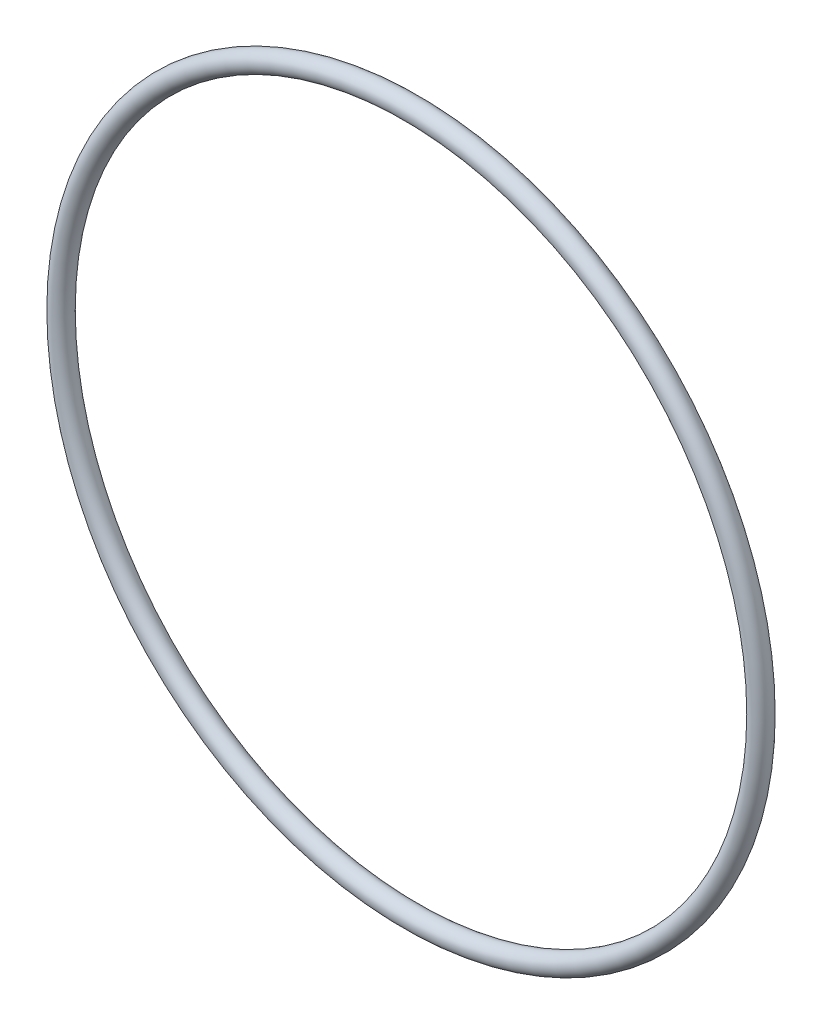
from build123d import *

# Parameters (mm, degrees)
BASE_SWEEP_PROFILE_R = 1.5875


with BuildPart() as part:
    # Base-Sweep: sweep along a path in Sketch-path
    with BuildLine(Plane.XY) as base_sweep_path:
        CenterArc((0, 0), 55.245, 0, 360)
    # Base-Sweep profile (on start of the path) → Base-Sweep (sweep)
    with BuildSketch(Plane(origin=(55.245, 0, 0), x_dir=(0, 0, 1), z_dir=(0, 1, 0))):
        Circle(BASE_SWEEP_PROFILE_R)
    sweep(path=base_sweep_path.line)


solid = part.part
